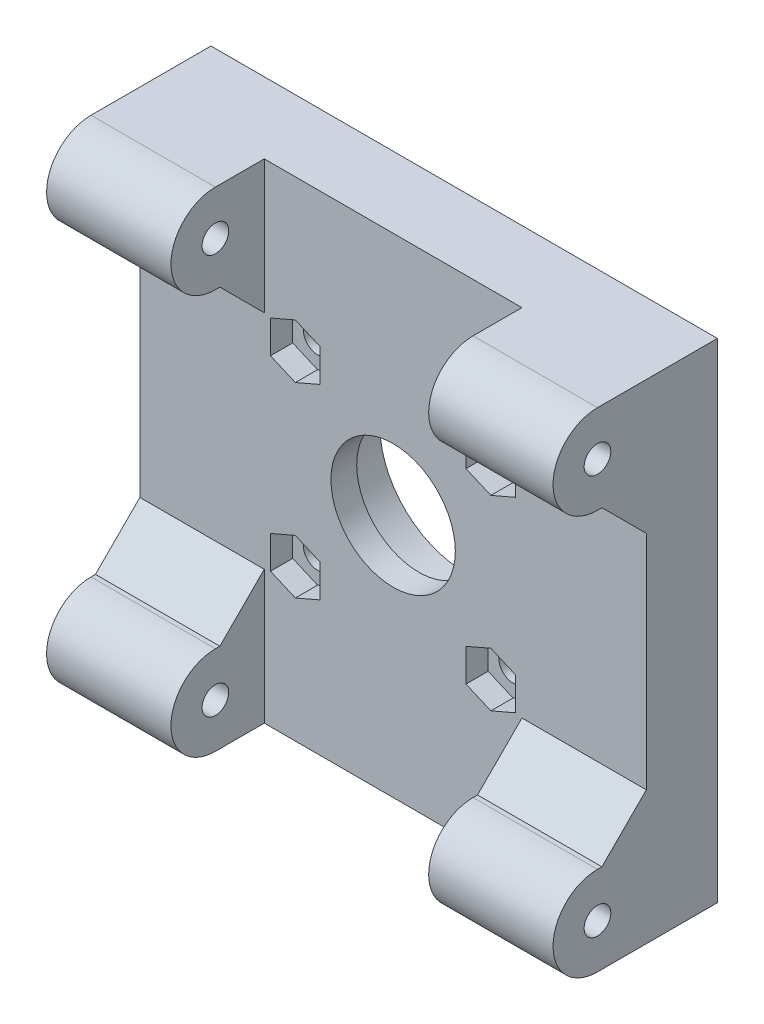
from build123d import *

# Parameters (mm, degrees)
SKETCH_1_W          = 57
SKETCH_1_H          = 55
EXTRUDE_1_DEPTH     = 8
SKETCH_4_R          = 5
SKETCH_4_R_2        = 1.5
EXTRUDE_2_DEPTH     = 14
SKETCH_5_R          = 7
SKETCH_5_R_2        = 1.6
CUT_EXTRUDE_1_DEPTH = 54.236934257
SKETCH_5_4_R        = 9.5
SKETCH_5_4_R_2      = 7
CUT_EXTRUDE_2_DEPTH = 5.1
CUT_EXTRUDE_START   = -2.5
SKETCH_6_R          = 1.6
CUT_EXTRUDE_3_DEPTH = 2.5
CHAMFER_1_SIZE      = 5


with BuildPart() as part:
    # Sketch 1 → Extrude 1 (new body)
    with BuildSketch(Plane.XY):
        with Locations((2.075531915, -11.959574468)):
            Rectangle(SKETCH_1_W, SKETCH_1_H)
    extrude(amount=EXTRUDE_1_DEPTH)

    # Sketch 4 → Extrude 2 (add)
    # profile 1 of 4: a face of its own
    with BuildSketch(Plane.ZY.offset(26.424468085)):
        with BuildLine():
            Line((8, 15.540425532), (8, 5.540425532))
            Line((8, 5.540425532), (13.5, 5.540425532))
            ThreePointArc((13.5, 5.540425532), (8.5, 10.540425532), (13.5, 15.540425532))
            Line((13.5, 15.540425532), (8, 15.540425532))
        make_face()
    # profile 2 of 4: a face of its own
    with BuildSketch(Plane.ZY.offset(26.424468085)):
        with Locations((13.5, 10.540425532)):
            Circle(SKETCH_4_R)
        with Locations(Location((13.5, 10.540425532, 0), (0, 0, 270))):
            Circle(SKETCH_4_R_2, mode=Mode.SUBTRACT)
    # profile 3 of 4: a face of its own
    with BuildSketch(Plane.ZY.offset(26.424468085)):
        with Locations((13.5, -34.459574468)):
            Circle(SKETCH_4_R)
        with Locations(Location((13.5, -34.459574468, 0), (0, 0, 270))):
            Circle(SKETCH_4_R_2, mode=Mode.SUBTRACT)
    # profile 4 of 4: a face of its own
    with BuildSketch(Plane.ZY.offset(26.424468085)):
        with BuildLine():
            Line((13.5, -29.459574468), (8, -29.459574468))
            Line((8, -29.459574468), (8, -39.459574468))
            Line((8, -39.459574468), (13.5, -39.459574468))
            ThreePointArc((13.5, -39.459574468), (8.5, -34.459574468), (13.5, -29.459574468))
        make_face()
    extrude_2 = extrude(amount=-EXTRUDE_2_DEPTH)

    # Mirror 1: Extrude 2 across plane
    add(extrude_2.mirror(Plane.ZY.offset(-2.075531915)))

    # Sketch 5 → Cut-Extrude 1 (cut, through all)
    with BuildSketch(Plane(origin=(0, 0, 0), x_dir=(-1, 0, 0), z_dir=(0, 0, -1))):
        with Locations((-2.075531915, -11.959574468)):
            Circle(SKETCH_5_R)
        with Locations((-13.075531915, -1.459574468)):
            Circle(SKETCH_5_R_2)
        with Locations((8.924468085, -1.459574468)):
            Circle(SKETCH_5_R_2)
        with Locations((8.924468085, -22.459574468)):
            Circle(SKETCH_5_R_2)
        with Locations((-13.075531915, -22.459574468)):
            Circle(SKETCH_5_R_2)
    extrude(amount=-CUT_EXTRUDE_1_DEPTH, mode=Mode.SUBTRACT)

    # Sketch 5_4 → Cut-Extrude 2 (cut)
    with BuildSketch(Plane(origin=(0, 0, 0), x_dir=(-1, 0, 0), z_dir=(0, 0, -1))):
        with Locations((-2.075531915, -11.959574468)):
            Circle(SKETCH_5_4_R)
        with Locations((-2.075531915, -11.959574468)):
            Circle(SKETCH_5_4_R_2, mode=Mode.SUBTRACT)
    extrude(amount=-CUT_EXTRUDE_2_DEPTH, mode=Mode.SUBTRACT)

    # Sketch 6 → Cut-Extrude 3 (cut)
    # profile 1 of 5: a face of its own
    with BuildSketch(Plane.XY.offset(8).offset(CUT_EXTRUDE_START)):
        Polygon((-11.724578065, -3.300068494), (-8.924650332, -4.509574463), (-6.124578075, -3.300403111), (-6.124358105, 0.380919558), (-8.924285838, 1.590425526), (-11.724358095, 0.381254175), align=None)
        with Locations(Location((-8.924468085, -1.459574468, 0), (0, 0, 180))):
            Circle(SKETCH_6_R, mode=Mode.SUBTRACT)
    # profile 2 of 5: a face of its own
    with BuildSketch(Plane.XY.offset(8).offset(CUT_EXTRUDE_START)):
        Polygon((10.275421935, -3.300068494), (13.075349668, -4.509574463), (15.875421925, -3.300403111), (15.875641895, 0.380919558), (13.075714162, 1.590425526), (10.275641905, 0.381254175), align=None)
        with Locations(Location((13.075531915, -1.459574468, 0), (0, 0, 180))):
            Circle(SKETCH_6_R, mode=Mode.SUBTRACT)
    # profile 3 of 5: a face of its own
    with BuildSketch(Plane.XY.offset(8).offset(CUT_EXTRUDE_START)):
        Polygon((10.275421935, -24.300068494), (13.075349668, -25.509574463), (15.875421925, -24.300403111), (15.875641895, -20.619080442), (13.075714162, -19.409574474), (10.275641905, -20.618745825), align=None)
        with Locations(Location((13.075531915, -22.459574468, 0), (0, 0, 180))):
            Circle(SKETCH_6_R, mode=Mode.SUBTRACT)
    # profile 4 of 5: a face of its own
    with BuildSketch(Plane.XY.offset(8).offset(CUT_EXTRUDE_START)):
        Polygon((-11.724578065, -24.300068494), (-8.924650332, -25.509574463), (-6.124578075, -24.300403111), (-6.124358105, -20.619080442), (-8.924285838, -19.409574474), (-11.724358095, -20.618745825), align=None)
        with Locations(Location((-8.924468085, -22.459574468, 0), (0, 0, 180))):
            Circle(SKETCH_6_R, mode=Mode.SUBTRACT)
    # profile 5 of 5: a face of its own
    with BuildSketch(Plane.XY.offset(8).offset(CUT_EXTRUDE_START)):
        with Locations(Location((13.075531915, -22.459574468, 0), (0, 0, 180))):
            Circle(SKETCH_6_R)
    extrude(amount=CUT_EXTRUDE_3_DEPTH, mode=Mode.SUBTRACT)

    # Chamfer 1
    chamfer_1_edges = [part.edges().sort_by_distance(p)[0] for p in [
        (-19.424468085, 5.540425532, 8),
        (-19.424468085, -29.459574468, 8),
        (23.575531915, 5.540425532, 8),
        (23.575531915, -29.459574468, 8),
    ]]
    chamfer(chamfer_1_edges, length=CHAMFER_1_SIZE)


solid = part.part
